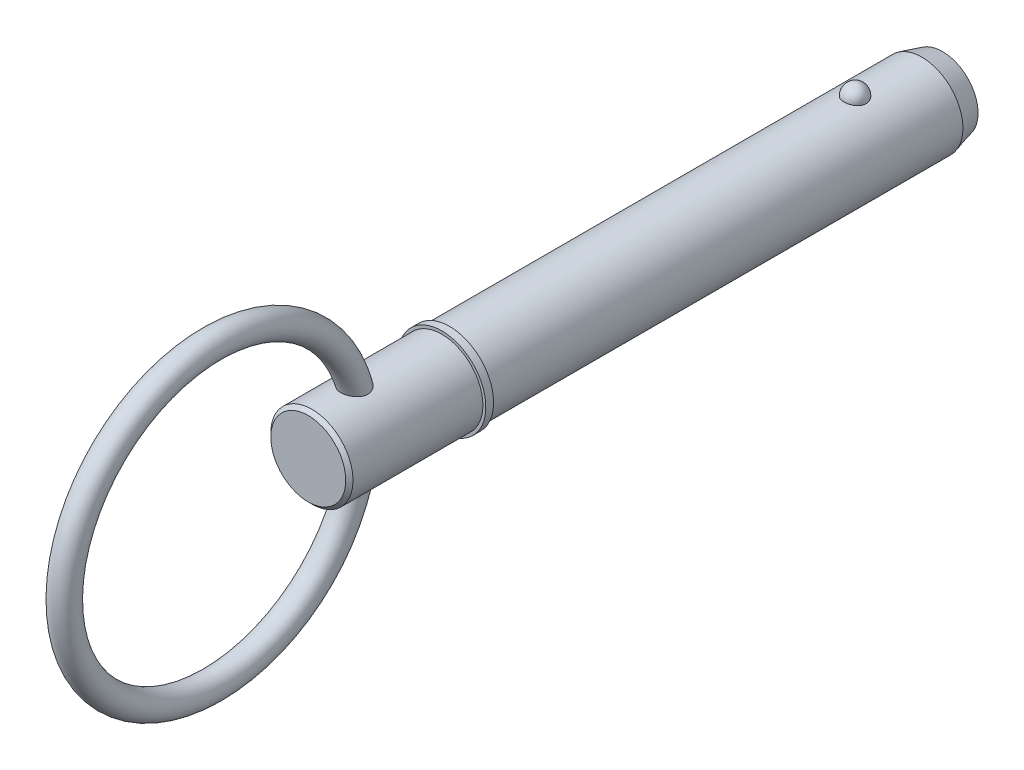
ISO-10303-21;
HEADER;
FILE_DESCRIPTION(('STEP AP214'),'2;1');
FILE_NAME('part.step','',(''),(''),'','','');
FILE_SCHEMA(('AUTOMOTIVE_DESIGN { 1 0 10303 214 1 1 1 1 }'));
ENDSEC;
DATA;
#1=APPLICATION_CONTEXT('core data for automotive mechanical design processes');
#2=APPLICATION_PROTOCOL_DEFINITION('international standard','automotive_design',2000,#1);
#3=PRODUCT_CONTEXT('',#1,'mechanical');
#4=PRODUCT('Part','Part','',(#3));
#5=PRODUCT_RELATED_PRODUCT_CATEGORY('part','',(#4));
#6=PRODUCT_DEFINITION_FORMATION('','',#4);
#7=PRODUCT_DEFINITION_CONTEXT('part definition',#1,'design');
#8=PRODUCT_DEFINITION('design','',#6,#7);
#9=PRODUCT_DEFINITION_SHAPE('','',#8);
#10=(LENGTH_UNIT() NAMED_UNIT(*) SI_UNIT(.MILLI.,.METRE.));
#11=(NAMED_UNIT(*) PLANE_ANGLE_UNIT() SI_UNIT($,.RADIAN.));
#12=(NAMED_UNIT(*) SI_UNIT($,.STERADIAN.) SOLID_ANGLE_UNIT());
#13=UNCERTAINTY_MEASURE_WITH_UNIT(LENGTH_MEASURE(1.E-05),#10,'distance_accuracy_value','');
#14=(GEOMETRIC_REPRESENTATION_CONTEXT(3) GLOBAL_UNCERTAINTY_ASSIGNED_CONTEXT((#13)) GLOBAL_UNIT_ASSIGNED_CONTEXT((#10,
#11,#12)) REPRESENTATION_CONTEXT('',''));
#15=CARTESIAN_POINT('',(0.,0.,0.));
#16=DIRECTION('',(0.,0.,1.));
#17=DIRECTION('',(1.,0.,0.));
#18=AXIS2_PLACEMENT_3D('',#15,#16,#17);
#19=CARTESIAN_POINT('',(0.,0.,76.2));
#20=DIRECTION('',(0.,0.,-1.));
#21=DIRECTION('',(-1.,0.,0.));
#22=AXIS2_PLACEMENT_3D('',#19,#20,#21);
#23=CYLINDRICAL_SURFACE('',#22,7.94);
#24=CARTESIAN_POINT('',(2.13020349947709,7.64891057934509,-2.15));
#25=CARTESIAN_POINT('',(2.1302012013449,7.64891247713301,-2.0297816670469));
#26=CARTESIAN_POINT('',(2.12037546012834,7.65166842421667,-1.90953383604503));
#27=CARTESIAN_POINT('',(2.08130792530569,7.66238579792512,-1.67243962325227));
#28=CARTESIAN_POINT('',(2.05205785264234,7.67034944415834,-1.55559471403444));
#29=CARTESIAN_POINT('',(1.97489181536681,7.69057749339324,-1.32869361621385));
#30=CARTESIAN_POINT('',(1.92698409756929,7.70283999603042,-1.21863445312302));
#31=CARTESIAN_POINT('',(1.81370645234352,7.73029430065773,-1.00831338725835));
#32=CARTESIAN_POINT('',(1.74833715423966,7.7454859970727,-0.908051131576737));
#33=CARTESIAN_POINT('',(1.60144242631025,7.77718699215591,-0.719628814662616));
#34=CARTESIAN_POINT('',(1.51984382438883,7.7937020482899,-0.631526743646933));
#35=CARTESIAN_POINT('',(1.34279837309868,7.82614685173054,-0.470411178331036));
#36=CARTESIAN_POINT('',(1.24735148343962,7.84207659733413,-0.397397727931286));
#37=CARTESIAN_POINT('',(1.04544839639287,7.87153116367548,-0.268681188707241));
#38=CARTESIAN_POINT('',(0.939022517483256,7.88506234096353,-0.212932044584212));
#39=CARTESIAN_POINT('',(0.717931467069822,7.90825597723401,-0.120080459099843));
#40=CARTESIAN_POINT('',(0.603267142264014,7.9179188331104,-0.0829761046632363));
#41=CARTESIAN_POINT('',(0.371015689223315,7.93216561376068,-0.0289596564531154));
#42=CARTESIAN_POINT('',(0.253510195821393,7.93683225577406,-0.0117183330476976));
#43=CARTESIAN_POINT('',(0.0171784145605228,7.94086051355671,0.00318921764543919));
#44=CARTESIAN_POINT('',(-0.101647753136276,7.94022260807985,0.000857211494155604));
#45=CARTESIAN_POINT('',(-0.335567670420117,7.93375751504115,-0.0231465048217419));
#46=CARTESIAN_POINT('',(-0.450690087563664,7.92799987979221,-0.0445590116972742));
#47=CARTESIAN_POINT('',(-0.675610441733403,7.91200792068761,-0.105760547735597));
#48=CARTESIAN_POINT('',(-0.785408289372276,7.90177352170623,-0.145549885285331));
#49=CARTESIAN_POINT('',(-0.997270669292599,7.87784802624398,-0.242675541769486));
#50=CARTESIAN_POINT('',(-1.0992893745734,7.86413823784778,-0.300107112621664));
#51=CARTESIAN_POINT('',(-1.29223659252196,7.83474718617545,-0.430887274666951));
#52=CARTESIAN_POINT('',(-1.38316404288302,7.81906573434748,-0.50423738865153));
#53=CARTESIAN_POINT('',(-1.55313516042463,7.78710451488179,-0.666358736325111));
#54=CARTESIAN_POINT('',(-1.63193689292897,7.77081906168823,-0.755382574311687));
#55=CARTESIAN_POINT('',(-1.77366356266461,7.73970270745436,-0.945507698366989));
#56=CARTESIAN_POINT('',(-1.83658745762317,7.72487190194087,-1.04660977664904));
#57=CARTESIAN_POINT('',(-1.94556640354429,7.6981535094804,-1.25927689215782));
#58=CARTESIAN_POINT('',(-1.99143480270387,7.6862989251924,-1.3709418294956));
#59=CARTESIAN_POINT('',(-2.06418311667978,7.66708387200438,-1.60066153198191));
#60=CARTESIAN_POINT('',(-2.0910635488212,7.65972328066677,-1.71871612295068));
#61=CARTESIAN_POINT('',(-2.12508507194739,7.65035479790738,-1.9573607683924));
#62=CARTESIAN_POINT('',(-2.13230490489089,7.64832555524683,-2.0779387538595));
#63=CARTESIAN_POINT('',(-2.12704767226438,7.64978921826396,-2.31862835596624));
#64=CARTESIAN_POINT('',(-2.1145710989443,7.6532819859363,-2.43873998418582));
#65=CARTESIAN_POINT('',(-2.07034166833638,7.66536368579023,-2.67451689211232));
#66=CARTESIAN_POINT('',(-2.03867758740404,7.67392914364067,-2.79020005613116));
#67=CARTESIAN_POINT('',(-1.95694065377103,7.69517736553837,-3.01446692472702));
#68=CARTESIAN_POINT('',(-1.90686710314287,7.70786028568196,-3.12305035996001));
#69=CARTESIAN_POINT('',(-1.78925555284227,7.73600831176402,-3.33065971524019));
#70=CARTESIAN_POINT('',(-1.72162904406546,7.75148739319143,-3.4296336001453));
#71=CARTESIAN_POINT('',(-1.57074739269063,7.78346215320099,-3.61466914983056));
#72=CARTESIAN_POINT('',(-1.48749169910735,7.79995786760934,-3.70073035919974));
#73=CARTESIAN_POINT('',(-1.30720250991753,7.83219119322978,-3.85783594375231));
#74=CARTESIAN_POINT('',(-1.2101234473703,7.84792605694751,-3.92882863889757));
#75=CARTESIAN_POINT('',(-1.00503150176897,7.87681523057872,-4.05342383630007));
#76=CARTESIAN_POINT('',(-0.897019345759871,7.88996971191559,-4.10702749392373));
#77=CARTESIAN_POINT('',(-0.674439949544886,7.91208451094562,-4.19477736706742));
#78=CARTESIAN_POINT('',(-0.559965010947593,7.92109245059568,-4.22914554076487));
#79=CARTESIAN_POINT('',(-0.326625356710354,7.93413878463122,-4.27838865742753));
#80=CARTESIAN_POINT('',(-0.207761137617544,7.93817773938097,-4.29326579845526));
#81=CARTESIAN_POINT('',(0.0287357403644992,7.94081322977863,-4.3030062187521));
#82=CARTESIAN_POINT('',(0.146353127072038,7.93950453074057,-4.29821797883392));
#83=CARTESIAN_POINT('',(0.379062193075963,7.93180098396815,-4.26955229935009));
#84=CARTESIAN_POINT('',(0.494153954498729,7.92540630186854,-4.24567548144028));
#85=CARTESIAN_POINT('',(0.718185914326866,7.90824874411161,-4.17962260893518));
#86=CARTESIAN_POINT('',(0.827145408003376,7.89750055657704,-4.13750805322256));
#87=CARTESIAN_POINT('',(1.03638036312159,7.87277755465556,-4.03615078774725));
#88=CARTESIAN_POINT('',(1.13665531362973,7.85880255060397,-3.97690707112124));
#89=CARTESIAN_POINT('',(1.32729731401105,7.82887859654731,-3.84189297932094));
#90=CARTESIAN_POINT('',(1.41749828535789,7.81290379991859,-3.76589388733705));
#91=CARTESIAN_POINT('',(1.58397257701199,7.78086330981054,-3.59992466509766));
#92=CARTESIAN_POINT('',(1.66024342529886,7.76479760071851,-3.50995206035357));
#93=CARTESIAN_POINT('',(1.79805631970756,7.73405928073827,-3.31688321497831));
#94=CARTESIAN_POINT('',(1.85933944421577,7.719413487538,-3.213597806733));
#95=CARTESIAN_POINT('',(1.96397499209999,7.69345992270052,-2.99796163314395));
#96=CARTESIAN_POINT('',(2.00733488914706,7.68215076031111,-2.88561466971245));
#97=CARTESIAN_POINT('',(2.07068045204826,7.66529896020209,-2.6699413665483));
#98=CARTESIAN_POINT('',(2.09296296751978,7.65919990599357,-2.56732606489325));
#99=CARTESIAN_POINT('',(2.12272535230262,7.65100492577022,-2.35981463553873));
#100=CARTESIAN_POINT('',(2.13020550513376,7.64890892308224,-2.25491855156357));
#101=CARTESIAN_POINT('',(2.13020349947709,7.64891057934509,-2.15));
#102=B_SPLINE_CURVE_WITH_KNOTS('',3,(#24,#25,#26,#27,#28,#29,#30,#31,#32,#33,#34,#35,#36,#37,
#38,#39,#40,#41,#42,#43,#44,#45,#46,#47,#48,#49,#50,#51,#52,#53,#54,#55,#56,#57,#58,#59,#60,#61,
#62,#63,#64,#65,#66,#67,#68,#69,#70,#71,#72,#73,#74,#75,#76,#77,#78,#79,#80,#81,#82,#83,#84,#85,
#86,#87,#88,#89,#90,#91,#92,#93,#94,#95,#96,#97,#98,#99,#100,#101),.UNSPECIFIED.,.T.,.F.,(4,2,2,
2,2,2,2,2,2,2,2,2,2,2,2,2,2,2,2,2,2,2,2,2,2,2,2,2,2,2,2,2,2,2,2,2,2,2,4),(0.,0.360277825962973,
0.720709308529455,1.0809816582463,1.44124102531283,1.80316307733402,2.16508618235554,
2.52603531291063,2.88694740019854,3.24178717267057,3.59659491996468,3.94665496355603,
4.2967208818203,4.64871108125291,5.00073496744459,5.35906196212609,5.71741247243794,
6.079576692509,6.44173104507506,6.80243279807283,7.16312553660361,7.52216203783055,
7.88121215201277,8.24210915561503,8.60301888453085,8.96514709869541,9.32725124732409,
9.68508606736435,10.0428805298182,10.3943622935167,10.7458326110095,11.0961268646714,
11.4464417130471,11.8018724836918,12.1573662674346,12.5186252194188,12.8797333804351,
13.1941658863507,13.5085923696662),.UNSPECIFIED.);
#103=CARTESIAN_POINT('',(2.13020349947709,7.64891057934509,-2.15));
#104=VERTEX_POINT('',#103);
#105=EDGE_CURVE('E103',#104,#104,#102,.T.);
#106=ORIENTED_EDGE('',*,*,#105,.T.);
#107=EDGE_LOOP('',(#106));
#108=FACE_BOUND('',#107,.T.);
#109=CARTESIAN_POINT('',(0.,0.,-15.0500000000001));
#110=DIRECTION('',(0.,0.,-1.));
#111=DIRECTION('',(-1.,0.,0.));
#112=AXIS2_PLACEMENT_3D('',#109,#110,#111);
#113=CIRCLE('',#112,7.94);
#114=CARTESIAN_POINT('',(-7.94,0.,-15.0500000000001));
#115=VERTEX_POINT('',#114);
#116=EDGE_CURVE('E111',#115,#115,#113,.F.);
#117=ORIENTED_EDGE('',*,*,#116,.T.);
#118=EDGE_LOOP('',(#117));
#119=FACE_BOUND('',#118,.T.);
#120=CARTESIAN_POINT('',(0.,0.,76.2));
#121=DIRECTION('',(0.,0.,1.));
#122=DIRECTION('',(1.,0.,0.));
#123=AXIS2_PLACEMENT_3D('',#120,#121,#122);
#124=CIRCLE('',#123,7.94);
#125=CARTESIAN_POINT('',(7.94,0.,76.2));
#126=VERTEX_POINT('',#125);
#127=EDGE_CURVE('E109',#126,#126,#124,.T.);
#128=ORIENTED_EDGE('',*,*,#127,.F.);
#129=EDGE_LOOP('',(#128));
#130=FACE_BOUND('',#129,.T.);
#131=ADVANCED_FACE('F39',(#108,#119,#130),#23,.T.);
#132=CARTESIAN_POINT('',(0.,0.,-19.05));
#133=DIRECTION('',(0.,0.,-1.));
#134=DIRECTION('',(-1.,0.,0.));
#135=AXIS2_PLACEMENT_3D('',#132,#133,#134);
#136=PLANE('',#135);
#137=CARTESIAN_POINT('',(0.,0.,-19.05));
#138=DIRECTION('',(0.,0.,-1.));
#139=DIRECTION('',(-1.,0.,0.));
#140=AXIS2_PLACEMENT_3D('',#137,#138,#139);
#141=CIRCLE('',#140,6.86820323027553);
#142=CARTESIAN_POINT('',(-6.86820323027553,0.,-19.05));
#143=VERTEX_POINT('',#142);
#144=EDGE_CURVE('E143',#143,#143,#141,.T.);
#145=ORIENTED_EDGE('',*,*,#144,.T.);
#146=EDGE_LOOP('',(#145));
#147=FACE_BOUND('',#146,.T.);
#148=ADVANCED_FACE('F89',(#147),#136,.T.);
#149=CARTESIAN_POINT('',(0.,0.,-19.05));
#150=DIRECTION('',(0.,0.,1.));
#151=DIRECTION('',(1.,0.,0.));
#152=AXIS2_PLACEMENT_3D('',#149,#150,#151);
#153=CONICAL_SURFACE('',#152,6.86820323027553,0.26179938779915);
#154=ORIENTED_EDGE('',*,*,#116,.F.);
#155=EDGE_LOOP('',(#154));
#156=FACE_BOUND('',#155,.T.);
#157=ORIENTED_EDGE('',*,*,#144,.F.);
#158=EDGE_LOOP('',(#157));
#159=FACE_BOUND('',#158,.T.);
#160=ADVANCED_FACE('F95',(#156,#159),#153,.T.);
#161=CARTESIAN_POINT('',(0.,7.94,-2.15));
#162=DIRECTION('',(0.,1.,0.));
#163=DIRECTION('',(0.,0.,-1.));
#164=AXIS2_PLACEMENT_3D('',#161,#162,#163);
#165=SPHERICAL_SURFACE('',#164,2.15);
#166=ORIENTED_EDGE('',*,*,#105,.F.);
#167=EDGE_LOOP('',(#166));
#168=FACE_BOUND('',#167,.T.);
#169=ADVANCED_FACE('F114',(#168),#165,.T.);
#170=CARTESIAN_POINT('',(0.,0.,76.2));
#171=DIRECTION('',(0.,0.,-1.));
#172=DIRECTION('',(-1.,0.,0.));
#173=AXIS2_PLACEMENT_3D('',#170,#171,#172);
#174=PLANE('',#173);
#175=ORIENTED_EDGE('',*,*,#127,.T.);
#176=EDGE_LOOP('',(#175));
#177=FACE_BOUND('',#176,.T.);
#178=CARTESIAN_POINT('',(0.,0.,76.2));
#179=DIRECTION('',(0.,0.,-1.));
#180=DIRECTION('',(-1.,0.,0.));
#181=AXIS2_PLACEMENT_3D('',#178,#179,#180);
#182=CIRCLE('',#181,8.5);
#183=CARTESIAN_POINT('',(-8.5,0.,76.2));
#184=VERTEX_POINT('',#183);
#185=EDGE_CURVE('E110',#184,#184,#182,.T.);
#186=ORIENTED_EDGE('',*,*,#185,.T.);
#187=EDGE_LOOP('',(#186));
#188=FACE_BOUND('',#187,.T.);
#189=ADVANCED_FACE('F118',(#177,#188),#174,.T.);
#190=CARTESIAN_POINT('',(0.,0.,33.7287874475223));
#191=DIRECTION('',(0.,0.,-1.));
#192=DIRECTION('',(-1.,0.,0.));
#193=AXIS2_PLACEMENT_3D('',#190,#191,#192);
#194=CYLINDRICAL_SURFACE('',#193,8.5);
#195=CARTESIAN_POINT('',(0.,0.,77.7));
#196=DIRECTION('',(0.,0.,-1.));
#197=DIRECTION('',(-1.,0.,0.));
#198=AXIS2_PLACEMENT_3D('',#195,#196,#197);
#199=CIRCLE('',#198,8.5);
#200=CARTESIAN_POINT('',(-8.5,0.,77.7));
#201=VERTEX_POINT('',#200);
#202=EDGE_CURVE('E135',#201,#201,#199,.T.);
#203=ORIENTED_EDGE('',*,*,#202,.T.);
#204=EDGE_LOOP('',(#203));
#205=FACE_BOUND('',#204,.T.);
#206=ORIENTED_EDGE('',*,*,#185,.F.);
#207=EDGE_LOOP('',(#206));
#208=FACE_BOUND('',#207,.T.);
#209=ADVANCED_FACE('F122',(#205,#208),#194,.T.);
#210=CARTESIAN_POINT('',(0.,8.5,77.7));
#211=DIRECTION('',(0.,0.,1.));
#212=DIRECTION('',(1.,0.,0.));
#213=AXIS2_PLACEMENT_3D('',#210,#211,#212);
#214=PLANE('',#213);
#215=CARTESIAN_POINT('',(0.,0.,77.7));
#216=DIRECTION('',(0.,0.,1.));
#217=DIRECTION('',(1.,0.,0.));
#218=AXIS2_PLACEMENT_3D('',#215,#216,#217);
#219=CIRCLE('',#218,7.94);
#220=CARTESIAN_POINT('',(7.94,0.,77.7));
#221=VERTEX_POINT('',#220);
#222=EDGE_CURVE('E113',#221,#221,#219,.T.);
#223=ORIENTED_EDGE('',*,*,#222,.F.);
#224=EDGE_LOOP('',(#223));
#225=FACE_BOUND('',#224,.T.);
#226=ORIENTED_EDGE('',*,*,#202,.F.);
#227=EDGE_LOOP('',(#226));
#228=FACE_BOUND('',#227,.T.);
#229=ADVANCED_FACE('F86',(#225,#228),#214,.T.);
#230=CARTESIAN_POINT('',(0.,0.,103.51));
#231=DIRECTION('',(0.,0.,-1.));
#232=DIRECTION('',(-1.,0.,0.));
#233=AXIS2_PLACEMENT_3D('',#230,#231,#232);
#234=CYLINDRICAL_SURFACE('',#233,7.94);
#235=CARTESIAN_POINT('',(-1.15544091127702,-7.85547938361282,92.311910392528));
#236=CARTESIAN_POINT('',(-1.03089695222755,-7.87379554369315,92.2496153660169));
#237=CARTESIAN_POINT('',(-0.900845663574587,-7.8898743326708,92.1975936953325));
#238=CARTESIAN_POINT('',(-0.633417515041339,-7.91583465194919,92.115265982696));
#239=CARTESIAN_POINT('',(-0.496037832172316,-7.92571377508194,92.0849683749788));
#240=CARTESIAN_POINT('',(-0.217881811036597,-7.93823020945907,92.0467734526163));
#241=CARTESIAN_POINT('',(-0.0771057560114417,-7.94086812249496,92.0388742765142));
#242=CARTESIAN_POINT('',(0.203828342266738,-7.93862624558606,92.0456489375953));
#243=CARTESIAN_POINT('',(0.343986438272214,-7.93374711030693,92.0603208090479));
#244=CARTESIAN_POINT('',(0.619544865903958,-7.9169944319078,92.1118776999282));
#245=CARTESIAN_POINT('',(0.754950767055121,-7.9051293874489,92.148735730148));
#246=CARTESIAN_POINT('',(1.01737529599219,-7.8756583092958,92.2438425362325));
#247=CARTESIAN_POINT('',(1.14439334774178,-7.85805188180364,92.3020927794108));
#248=CARTESIAN_POINT('',(1.38668443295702,-7.81893907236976,92.4388428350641));
#249=CARTESIAN_POINT('',(1.50193494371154,-7.79742542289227,92.5173804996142));
#250=CARTESIAN_POINT('',(1.71711272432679,-7.75288428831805,92.6928724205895));
#251=CARTESIAN_POINT('',(1.81704089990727,-7.72985689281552,92.7898255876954));
#252=CARTESIAN_POINT('',(1.99787261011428,-7.68509802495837,92.9988714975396));
#253=CARTESIAN_POINT('',(2.07893183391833,-7.66335713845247,93.1108273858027));
#254=CARTESIAN_POINT('',(2.22076589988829,-7.62346723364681,93.3474809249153));
#255=CARTESIAN_POINT('',(2.28154607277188,-7.6053172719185,93.4721752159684));
#256=CARTESIAN_POINT('',(2.38011540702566,-7.57504217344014,93.7276189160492));
#257=CARTESIAN_POINT('',(2.41840843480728,-7.56278621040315,93.8581588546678));
#258=CARTESIAN_POINT('',(2.47363993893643,-7.54490265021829,94.1240951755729));
#259=CARTESIAN_POINT('',(2.49057788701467,-7.53927521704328,94.2594916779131));
#260=CARTESIAN_POINT('',(2.50351014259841,-7.53499042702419,94.5324287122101));
#261=CARTESIAN_POINT('',(2.49933630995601,-7.53638902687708,94.6699777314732));
#262=CARTESIAN_POINT('',(2.47072547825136,-7.54581524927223,94.9426982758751));
#263=CARTESIAN_POINT('',(2.44628184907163,-7.55384504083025,95.0778690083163));
#264=CARTESIAN_POINT('',(2.3758931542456,-7.57629160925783,95.3530857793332));
#265=CARTESIAN_POINT('',(2.32844094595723,-7.5911515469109,95.4927089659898));
#266=CARTESIAN_POINT('',(2.21332780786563,-7.62550828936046,95.7627818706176));
#267=CARTESIAN_POINT('',(2.14565489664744,-7.64500784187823,95.8932260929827));
#268=CARTESIAN_POINT('',(1.98438755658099,-7.68852412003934,96.1537020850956));
#269=CARTESIAN_POINT('',(1.88896913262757,-7.71279219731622,96.2825698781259));
#270=CARTESIAN_POINT('',(1.67743245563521,-7.76154719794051,96.522112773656));
#271=CARTESIAN_POINT('',(1.56130644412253,-7.78603420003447,96.6327810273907));
#272=CARTESIAN_POINT('',(1.31168281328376,-7.83191501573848,96.8301000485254));
#273=CARTESIAN_POINT('',(1.17841631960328,-7.85334315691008,96.9170293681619));
#274=CARTESIAN_POINT('',(0.967442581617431,-7.88116219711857,97.0266577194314));
#275=CARTESIAN_POINT('',(0.895283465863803,-7.88971376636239,97.0597363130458));
#276=CARTESIAN_POINT('',(0.747777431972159,-7.90505596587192,97.1184005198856));
#277=CARTESIAN_POINT('',(0.672431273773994,-7.91184701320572,97.1439879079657));
#278=CARTESIAN_POINT('',(0.53057561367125,-7.92252382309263,97.1839121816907));
#279=CARTESIAN_POINT('',(0.46439476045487,-7.92668987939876,97.199349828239));
#280=CARTESIAN_POINT('',(0.330815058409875,-7.9333870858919,97.2240698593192));
#281=CARTESIAN_POINT('',(0.263416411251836,-7.93591850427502,97.2333532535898));
#282=CARTESIAN_POINT('',(0.128041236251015,-7.93925585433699,97.2455779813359));
#283=CARTESIAN_POINT('',(0.0600650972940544,-7.94006286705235,97.2485232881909));
#284=CARTESIAN_POINT('',(-0.0758408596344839,-7.93992929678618,97.2480336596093));
#285=CARTESIAN_POINT('',(-0.143770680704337,-7.93898884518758,97.2445992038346));
#286=CARTESIAN_POINT('',(-0.330023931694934,-7.93402174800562,97.2264060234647));
#287=CARTESIAN_POINT('',(-0.447720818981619,-7.92820264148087,97.2050608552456));
#288=CARTESIAN_POINT('',(-0.677833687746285,-7.91185818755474,97.1440930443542));
#289=CARTESIAN_POINT('',(-0.790248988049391,-7.90133223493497,97.1044680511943));
#290=CARTESIAN_POINT('',(-1.01082100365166,-7.8762011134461,97.0074365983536));
#291=CARTESIAN_POINT('',(-1.1187367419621,-7.86147932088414,96.949515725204));
#292=CARTESIAN_POINT('',(-1.32464461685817,-7.8294189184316,96.8187556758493));
#293=CARTESIAN_POINT('',(-1.42263264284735,-7.81207923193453,96.7459103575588));
#294=CARTESIAN_POINT('',(-1.62038324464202,-7.77363945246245,96.5765366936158));
#295=CARTESIAN_POINT('',(-1.7184938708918,-7.75235190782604,96.4781231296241));
#296=CARTESIAN_POINT('',(-1.89908721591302,-7.71010284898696,96.2677830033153));
#297=CARTESIAN_POINT('',(-1.9815587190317,-7.68914157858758,96.1558468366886));
#298=CARTESIAN_POINT('',(-2.13974270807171,-7.64674394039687,95.9051085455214));
#299=CARTESIAN_POINT('',(-2.21304020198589,-7.62562536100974,95.7647194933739));
#300=CARTESIAN_POINT('',(-2.33615659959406,-7.58881542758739,95.4732666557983));
#301=CARTESIAN_POINT('',(-2.38596943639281,-7.57312547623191,95.3222001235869));
#302=CARTESIAN_POINT('',(-2.46059473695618,-7.54921618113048,95.0104922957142));
#303=CARTESIAN_POINT('',(-2.48494918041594,-7.54113395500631,94.8497288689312));
#304=CARTESIAN_POINT('',(-2.50480773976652,-7.53456588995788,94.5262447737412));
#305=CARTESIAN_POINT('',(-2.50033692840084,-7.53607171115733,94.3635259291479));
#306=CARTESIAN_POINT('',(-2.46306926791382,-7.54832452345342,94.0571659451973));
#307=CARTESIAN_POINT('',(-2.4329569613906,-7.55819528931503,93.9131623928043));
#308=CARTESIAN_POINT('',(-2.34806892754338,-7.58499431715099,93.6333040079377));
#309=CARTESIAN_POINT('',(-2.29330013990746,-7.60192059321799,93.4974468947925));
#310=CARTESIAN_POINT('',(-2.16523724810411,-7.63933506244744,93.2476573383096));
#311=CARTESIAN_POINT('',(-2.09353456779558,-7.65948502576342,93.1328530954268));
#312=CARTESIAN_POINT('',(-1.93200913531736,-7.7018104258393,92.9172680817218));
#313=CARTESIAN_POINT('',(-1.84219262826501,-7.72398516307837,92.8164824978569));
#314=CARTESIAN_POINT('',(-1.65746337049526,-7.76558957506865,92.6413148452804));
#315=CARTESIAN_POINT('',(-1.56413624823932,-7.78505810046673,92.5652591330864));
#316=CARTESIAN_POINT('',(-1.36706423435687,-7.82207051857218,92.4275357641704));
#317=CARTESIAN_POINT('',(-1.26331856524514,-7.83961426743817,92.3658691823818));
#318=CARTESIAN_POINT('',(-1.15544091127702,-7.85547938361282,92.311910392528));
#319=B_SPLINE_CURVE_WITH_KNOTS('',3,(#235,#236,#237,#238,#239,#240,#241,#242,#243,#244,#245,
#246,#247,#248,#249,#250,#251,#252,#253,#254,#255,#256,#257,#258,#259,#260,#261,#262,#263,#264,
#265,#266,#267,#268,#269,#270,#271,#272,#273,#274,#275,#276,#277,#278,#279,#280,#281,#282,#283,
#284,#285,#286,#287,#288,#289,#290,#291,#292,#293,#294,#295,#296,#297,#298,#299,#300,#301,#302,
#303,#304,#305,#306,#307,#308,#309,#310,#311,#312,#313,#314,#315,#316,#317,#318),.UNSPECIFIED.,
.T.,.F.,(4,2,2,2,2,2,2,2,2,2,2,2,2,2,2,2,2,2,2,2,2,2,2,2,2,2,2,2,2,2,2,2,2,2,2,2,2,2,2,2,2,4),
(0.,0.420927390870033,0.842018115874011,1.26307384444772,1.68409290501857,2.10460083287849,
2.52513760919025,2.94646475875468,3.36776699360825,3.7854589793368,4.20304108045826,
4.61086922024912,5.0187074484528,5.42979890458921,5.84102487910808,6.28383316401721,
6.72690434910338,7.21113455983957,7.69554657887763,8.1740030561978,8.41316278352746,
8.65226580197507,8.85622998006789,9.0601606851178,9.2639635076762,9.46775100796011,
9.82521046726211,10.1827159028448,10.5513335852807,10.9201032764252,11.3402098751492,
11.7606166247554,12.2377707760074,12.715048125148,13.2007716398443,13.6860727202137,
14.1260485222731,14.5659005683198,14.9745225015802,15.3830037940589,15.7475760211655,
16.1121754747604),.UNSPECIFIED.);
#320=CARTESIAN_POINT('',(-1.15544091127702,-7.85547938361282,92.311910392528));
#321=VERTEX_POINT('',#320);
#322=EDGE_CURVE('E10',#321,#321,#319,.T.);
#323=ORIENTED_EDGE('',*,*,#322,.F.);
#324=EDGE_LOOP('',(#323));
#325=FACE_BOUND('',#324,.T.);
#326=CARTESIAN_POINT('',(-1.15544091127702,7.85547938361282,92.311910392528));
#327=CARTESIAN_POINT('',(-1.27857961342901,7.83736699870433,92.3735072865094));
#328=CARTESIAN_POINT('',(-1.39638360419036,7.8170599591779,92.4451720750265));
#329=CARTESIAN_POINT('',(-1.61803025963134,7.77421032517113,92.6070825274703));
#330=CARTESIAN_POINT('',(-1.72186951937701,7.7516671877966,92.6973327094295));
#331=CARTESIAN_POINT('',(-1.91269683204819,7.70680387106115,92.8943958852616));
#332=CARTESIAN_POINT('',(-1.99967065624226,7.68448389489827,93.0012227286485));
#333=CARTESIAN_POINT('',(-2.15412555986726,7.64262858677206,93.2286078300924));
#334=CARTESIAN_POINT('',(-2.22161184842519,7.62309251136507,93.3491624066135));
#335=CARTESIAN_POINT('',(-2.3342927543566,7.5893410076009,93.598377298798));
#336=CARTESIAN_POINT('',(-2.37985628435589,7.57503857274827,93.7268591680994));
#337=CARTESIAN_POINT('',(-2.44955571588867,7.55278941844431,93.990011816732));
#338=CARTESIAN_POINT('',(-2.47369226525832,7.54484250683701,94.1246824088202));
#339=CARTESIAN_POINT('',(-2.5005961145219,7.53596831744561,94.3961377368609));
#340=CARTESIAN_POINT('',(-2.50339277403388,7.53503139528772,94.5329193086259));
#341=CARTESIAN_POINT('',(-2.48855779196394,7.53994222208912,94.8052240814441));
#342=CARTESIAN_POINT('',(-2.47092012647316,7.54579197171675,94.9407468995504));
#343=CARTESIAN_POINT('',(-2.41469361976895,7.56397908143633,95.2162931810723));
#344=CARTESIAN_POINT('',(-2.37479606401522,7.57671999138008,95.3560213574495));
#345=CARTESIAN_POINT('',(-2.27489955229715,7.60730881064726,95.6275158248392));
#346=CARTESIAN_POINT('',(-2.21489004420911,7.6251594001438,95.7592778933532));
#347=CARTESIAN_POINT('',(-2.06943931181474,7.66598084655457,96.0245250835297));
#348=CARTESIAN_POINT('',(-1.98208275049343,7.68928197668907,96.1569147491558));
#349=CARTESIAN_POINT('',(-1.78658869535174,7.73704343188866,96.4052357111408));
#350=CARTESIAN_POINT('',(-1.67843905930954,7.76150442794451,96.521157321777));
#351=CARTESIAN_POINT('',(-1.44142605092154,7.80900750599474,96.7336999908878));
#352=CARTESIAN_POINT('',(-1.31231821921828,7.83202775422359,96.8300586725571));
#353=CARTESIAN_POINT('',(-1.10627655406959,7.86286215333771,96.9546145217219));
#354=CARTESIAN_POINT('',(-1.03552563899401,7.87252500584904,96.9928053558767));
#355=CARTESIAN_POINT('',(-0.890375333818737,7.89025728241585,97.0618851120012));
#356=CARTESIAN_POINT('',(-0.815978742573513,7.89832790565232,97.0927795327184));
#357=CARTESIAN_POINT('',(-0.674180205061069,7.91160332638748,97.1430828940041));
#358=CARTESIAN_POINT('',(-0.607145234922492,7.91704543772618,97.163468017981));
#359=CARTESIAN_POINT('',(-0.471385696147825,7.92628663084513,97.1978763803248));
#360=CARTESIAN_POINT('',(-0.402662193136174,7.93008672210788,97.2119035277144));
#361=CARTESIAN_POINT('',(-0.264153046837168,7.9359070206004,97.233322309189));
#362=CARTESIAN_POINT('',(-0.19436813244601,7.9379283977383,97.2407183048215));
#363=CARTESIAN_POINT('',(-0.0544054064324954,7.940122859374,97.2487430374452));
#364=CARTESIAN_POINT('',(0.0157723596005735,7.94029615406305,97.2493725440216));
#365=CARTESIAN_POINT('',(0.206295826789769,7.93822912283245,97.2418250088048));
#366=CARTESIAN_POINT('',(0.326425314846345,7.93416340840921,97.2269891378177));
#367=CARTESIAN_POINT('',(0.562310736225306,7.92094769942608,97.1780777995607));
#368=CARTESIAN_POINT('',(0.678066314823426,7.91179729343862,97.14400077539));
#369=CARTESIAN_POINT('',(0.903029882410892,7.88929555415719,97.0582699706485));
#370=CARTESIAN_POINT('',(1.01220356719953,7.87592415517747,97.0065321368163));
#371=CARTESIAN_POINT('',(1.22142047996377,7.84620431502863,96.8877939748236));
#372=CARTESIAN_POINT('',(1.32146048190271,7.82985482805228,96.8207882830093));
#373=CARTESIAN_POINT('',(1.52328754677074,7.7932678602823,96.6643092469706));
#374=CARTESIAN_POINT('',(1.6236508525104,7.77280069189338,96.5730560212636));
#375=CARTESIAN_POINT('',(1.80985117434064,7.73156849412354,96.3768153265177));
#376=CARTESIAN_POINT('',(1.89567824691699,7.71080327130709,96.2718185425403));
#377=CARTESIAN_POINT('',(2.06302404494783,7.66785771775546,96.0345434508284));
#378=CARTESIAN_POINT('',(2.14213178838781,7.64590590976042,95.900514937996));
#379=CARTESIAN_POINT('',(2.27825755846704,7.60645646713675,95.6209949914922));
#380=CARTESIAN_POINT('',(2.33526577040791,7.58896081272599,95.4754984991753));
#381=CARTESIAN_POINT('',(2.42707573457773,7.56011538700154,95.170242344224));
#382=CARTESIAN_POINT('',(2.4608459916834,7.54905411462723,95.0101404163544));
#383=CARTESIAN_POINT('',(2.49980168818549,7.53624914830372,94.6861292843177));
#384=CARTESIAN_POINT('',(2.50500938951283,7.5344981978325,94.5222231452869));
#385=CARTESIAN_POINT('',(2.48594104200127,7.54080673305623,94.2099762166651));
#386=CARTESIAN_POINT('',(2.46407777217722,7.54806351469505,94.0614732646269));
#387=CARTESIAN_POINT('',(2.3945479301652,7.57040718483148,93.771258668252));
#388=CARTESIAN_POINT('',(2.34689355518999,7.58549037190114,93.6295438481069));
#389=CARTESIAN_POINT('',(2.2318274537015,7.62009243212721,93.3691410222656));
#390=CARTESIAN_POINT('',(2.16637710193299,7.63914093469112,93.2495179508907));
#391=CARTESIAN_POINT('',(2.01638736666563,7.68009146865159,93.0234609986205));
#392=CARTESIAN_POINT('',(1.93184850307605,7.7019934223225,92.9170267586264));
#393=CARTESIAN_POINT('',(1.74664202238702,7.74608439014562,92.7206697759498));
#394=CARTESIAN_POINT('',(1.64607913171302,7.76827073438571,92.6306474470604));
#395=CARTESIAN_POINT('',(1.43119791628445,7.81071401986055,92.4683086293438));
#396=CARTESIAN_POINT('',(1.31687846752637,7.83097080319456,92.3959935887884));
#397=CARTESIAN_POINT('',(1.07477437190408,7.86789551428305,92.2691492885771));
#398=CARTESIAN_POINT('',(0.946739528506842,7.88446964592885,92.2150698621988));
#399=CARTESIAN_POINT('',(0.683029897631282,7.91167708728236,92.1282136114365));
#400=CARTESIAN_POINT('',(0.547354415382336,7.92230985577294,92.0954387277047));
#401=CARTESIAN_POINT('',(0.271066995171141,7.93658630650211,92.051730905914));
#402=CARTESIAN_POINT('',(0.130424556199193,7.94017418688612,92.0409723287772));
#403=CARTESIAN_POINT('',(-0.150736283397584,7.93981282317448,92.0420624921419));
#404=CARTESIAN_POINT('',(-0.291254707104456,7.93586558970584,92.053905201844));
#405=CARTESIAN_POINT('',(-0.556023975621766,7.92151946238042,92.0978917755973));
#406=CARTESIAN_POINT('',(-0.680621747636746,7.91171585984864,92.1281668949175));
#407=CARTESIAN_POINT('',(-0.923476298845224,7.88705844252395,92.2067364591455));
#408=CARTESIAN_POINT('',(-1.04173303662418,7.87220459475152,92.2550310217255));
#409=CARTESIAN_POINT('',(-1.15544091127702,7.85547938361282,92.311910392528));
#410=B_SPLINE_CURVE_WITH_KNOTS('',3,(#326,#327,#328,#329,#330,#331,#332,#333,#334,#335,#336,
#337,#338,#339,#340,#341,#342,#343,#344,#345,#346,#347,#348,#349,#350,#351,#352,#353,#354,#355,
#356,#357,#358,#359,#360,#361,#362,#363,#364,#365,#366,#367,#368,#369,#370,#371,#372,#373,#374,
#375,#376,#377,#378,#379,#380,#381,#382,#383,#384,#385,#386,#387,#388,#389,#390,#391,#392,#393,
#394,#395,#396,#397,#398,#399,#400,#401,#402,#403,#404,#405,#406,#407,#408,#409),.UNSPECIFIED.,
.T.,.F.,(4,2,2,2,2,2,2,2,2,2,2,2,2,2,2,2,2,2,2,2,2,2,2,2,2,2,2,2,2,2,2,2,2,2,2,2,2,2,2,2,2,4),
(0.,0.416167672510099,0.83243663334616,1.24905527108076,1.66556244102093,2.07479168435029,
2.48400855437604,2.89266231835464,3.30143658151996,3.73725068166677,4.17329379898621,
4.65204873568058,5.13108409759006,5.61617224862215,5.85876072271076,6.1011657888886,
6.31168904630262,6.52208269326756,6.73233785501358,6.94256910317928,7.30398888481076,
7.66543791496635,8.02863174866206,8.39195337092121,8.801906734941,9.21213940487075,
9.68159903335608,10.1512669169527,10.6406305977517,11.1296128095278,11.5779838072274,
12.0261429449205,12.4372146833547,12.8482752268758,13.256751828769,13.6652618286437,
14.0832160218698,14.5012082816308,14.9224982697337,15.3436758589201,15.72796797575,
16.1122626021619),.UNSPECIFIED.);
#411=CARTESIAN_POINT('',(-1.15544091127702,7.85547938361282,92.311910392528));
#412=VERTEX_POINT('',#411);
#413=EDGE_CURVE('E51',#412,#412,#410,.T.);
#414=ORIENTED_EDGE('',*,*,#413,.F.);
#415=EDGE_LOOP('',(#414));
#416=FACE_BOUND('',#415,.T.);
#417=CARTESIAN_POINT('',(0.,0.,102.81));
#418=DIRECTION('',(0.,0.,-1.));
#419=DIRECTION('',(-1.,0.,0.));
#420=AXIS2_PLACEMENT_3D('',#417,#418,#419);
#421=CIRCLE('',#420,7.94);
#422=CARTESIAN_POINT('',(-7.94,0.,102.81));
#423=VERTEX_POINT('',#422);
#424=EDGE_CURVE('E65',#423,#423,#421,.T.);
#425=ORIENTED_EDGE('',*,*,#424,.T.);
#426=EDGE_LOOP('',(#425));
#427=FACE_BOUND('',#426,.T.);
#428=ORIENTED_EDGE('',*,*,#222,.T.);
#429=EDGE_LOOP('',(#428));
#430=FACE_BOUND('',#429,.T.);
#431=ADVANCED_FACE('F70',(#325,#416,#427,#430),#234,.T.);
#432=CARTESIAN_POINT('',(0.,0.,103.51));
#433=DIRECTION('',(0.,0.,-1.));
#434=DIRECTION('',(-1.,0.,0.));
#435=AXIS2_PLACEMENT_3D('',#432,#433,#434);
#436=PLANE('',#435);
#437=CARTESIAN_POINT('',(0.,0.,103.51));
#438=DIRECTION('',(0.,0.,-1.));
#439=DIRECTION('',(-1.,0.,0.));
#440=AXIS2_PLACEMENT_3D('',#437,#438,#439);
#441=CIRCLE('',#440,7.24000000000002);
#442=CARTESIAN_POINT('',(-7.24000000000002,0.,103.51));
#443=VERTEX_POINT('',#442);
#444=EDGE_CURVE('E58',#443,#443,#441,.F.);
#445=ORIENTED_EDGE('',*,*,#444,.T.);
#446=EDGE_LOOP('',(#445));
#447=FACE_BOUND('',#446,.T.);
#448=ADVANCED_FACE('F77',(#447),#436,.F.);
#449=CARTESIAN_POINT('',(0.,0.,102.81));
#450=DIRECTION('',(0.,0.,-1.));
#451=DIRECTION('',(-1.,0.,0.));
#452=AXIS2_PLACEMENT_3D('',#449,#450,#451);
#453=CONICAL_SURFACE('',#452,7.94,0.785398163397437);
#454=ORIENTED_EDGE('',*,*,#444,.F.);
#455=EDGE_LOOP('',(#454));
#456=FACE_BOUND('',#455,.T.);
#457=ORIENTED_EDGE('',*,*,#424,.F.);
#458=EDGE_LOOP('',(#457));
#459=FACE_BOUND('',#458,.T.);
#460=ADVANCED_FACE('F41',(#456,#459),#453,.T.);
#461=CARTESIAN_POINT('',(0.,0.,122.085));
#462=DIRECTION('',(1.,0.,0.));
#463=DIRECTION('',(0.,0.,-1.));
#464=AXIS2_PLACEMENT_3D('',#461,#462,#463);
#465=TOROIDAL_SURFACE('',#464,28.575,2.5);
#466=ORIENTED_EDGE('',*,*,#322,.T.);
#467=EDGE_LOOP('',(#466));
#468=FACE_BOUND('',#467,.T.);
#469=ORIENTED_EDGE('',*,*,#413,.T.);
#470=EDGE_LOOP('',(#469));
#471=FACE_BOUND('',#470,.T.);
#472=ADVANCED_FACE('F74',(#468,#471),#465,.T.);
#473=CLOSED_SHELL('',(#131,#148,#160,#169,#189,#209,#229,#431,#448,#460,#472));
#474=MANIFOLD_SOLID_BREP('B2',#473);
#475=ADVANCED_BREP_SHAPE_REPRESENTATION('',(#18,#474),#14);
#476=SHAPE_DEFINITION_REPRESENTATION(#9,#475);
ENDSEC;
END-ISO-10303-21;
